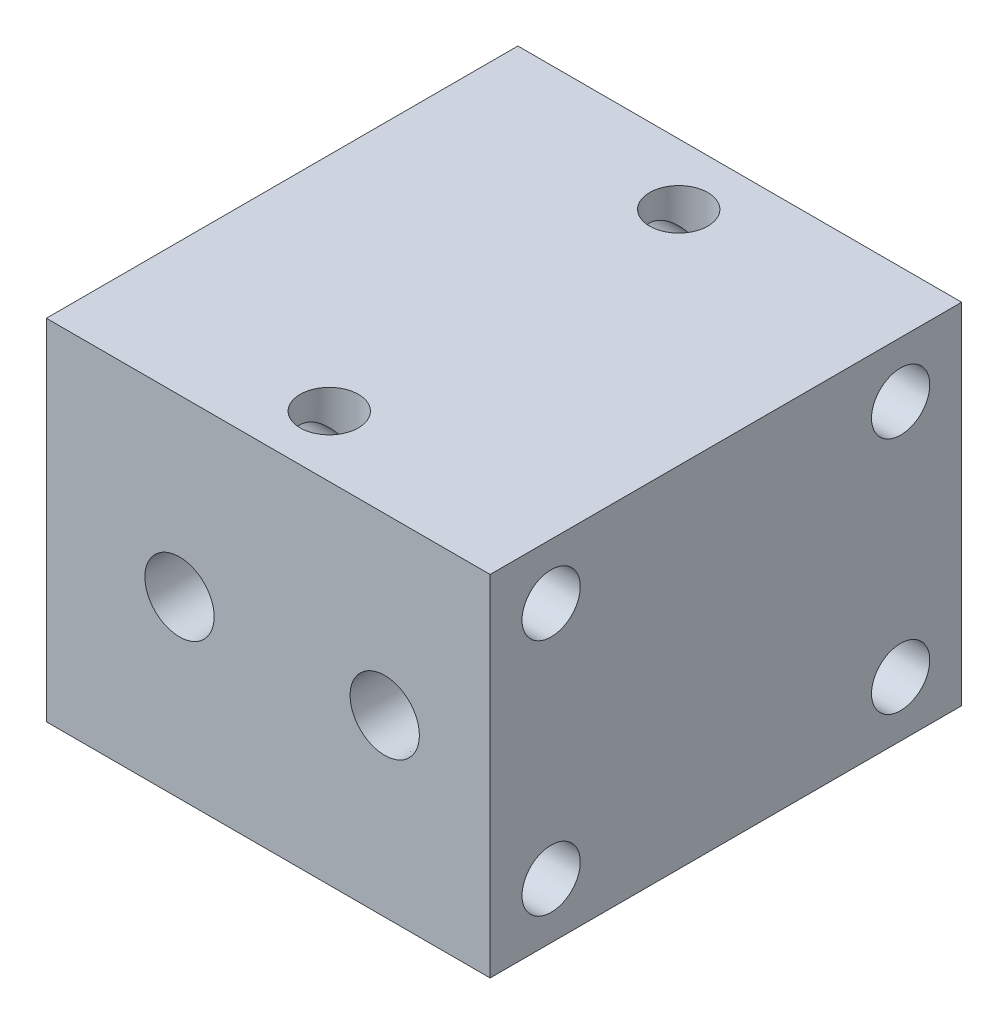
ISO-10303-21;
HEADER;
FILE_DESCRIPTION(('STEP AP214'),'2;1');
FILE_NAME('part.step','',(''),(''),'','','');
FILE_SCHEMA(('AUTOMOTIVE_DESIGN { 1 0 10303 214 1 1 1 1 }'));
ENDSEC;
DATA;
#1=APPLICATION_CONTEXT('core data for automotive mechanical design processes');
#2=APPLICATION_PROTOCOL_DEFINITION('international standard','automotive_design',2000,#1);
#3=PRODUCT_CONTEXT('',#1,'mechanical');
#4=PRODUCT('Part','Part','',(#3));
#5=PRODUCT_RELATED_PRODUCT_CATEGORY('part','',(#4));
#6=PRODUCT_DEFINITION_FORMATION('','',#4);
#7=PRODUCT_DEFINITION_CONTEXT('part definition',#1,'design');
#8=PRODUCT_DEFINITION('design','',#6,#7);
#9=PRODUCT_DEFINITION_SHAPE('','',#8);
#10=(LENGTH_UNIT() NAMED_UNIT(*) SI_UNIT(.MILLI.,.METRE.));
#11=(NAMED_UNIT(*) PLANE_ANGLE_UNIT() SI_UNIT($,.RADIAN.));
#12=(NAMED_UNIT(*) SI_UNIT($,.STERADIAN.) SOLID_ANGLE_UNIT());
#13=UNCERTAINTY_MEASURE_WITH_UNIT(LENGTH_MEASURE(1.E-05),#10,'distance_accuracy_value','');
#14=(GEOMETRIC_REPRESENTATION_CONTEXT(3) GLOBAL_UNCERTAINTY_ASSIGNED_CONTEXT((#13)) GLOBAL_UNIT_ASSIGNED_CONTEXT((#10,
#11,#12)) REPRESENTATION_CONTEXT('',''));
#15=CARTESIAN_POINT('',(0.,0.,0.));
#16=DIRECTION('',(0.,0.,1.));
#17=DIRECTION('',(1.,0.,0.));
#18=AXIS2_PLACEMENT_3D('',#15,#16,#17);
#19=CARTESIAN_POINT('',(0.,63.,31.5));
#20=DIRECTION('',(0.,-1.,0.));
#21=DIRECTION('',(0.,0.,-1.));
#22=AXIS2_PLACEMENT_3D('',#19,#20,#21);
#23=CYLINDRICAL_SURFACE('',#22,5.25);
#24=CARTESIAN_POINT('',(0.,9.99999999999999,31.5));
#25=DIRECTION('',(-0.707106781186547,-0.707106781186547,0.));
#26=DIRECTION('',(0.707106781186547,-0.707106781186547,0.));
#27=AXIS2_PLACEMENT_3D('',#24,#25,#26);
#28=ELLIPSE('',#27,7.42462120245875,5.25);
#29=CARTESIAN_POINT('',(0.,9.99999999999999,26.25));
#30=VERTEX_POINT('',#29);
#31=CARTESIAN_POINT('',(0.,9.99999999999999,36.75));
#32=VERTEX_POINT('',#31);
#33=EDGE_CURVE('E11',#30,#32,#28,.F.);
#34=ORIENTED_EDGE('',*,*,#33,.F.);
#35=CARTESIAN_POINT('',(0.,9.99999999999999,31.5));
#36=DIRECTION('',(0.707106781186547,-0.707106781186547,0.));
#37=DIRECTION('',(-0.707106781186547,-0.707106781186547,0.));
#38=AXIS2_PLACEMENT_3D('',#35,#36,#37);
#39=ELLIPSE('',#38,7.42462120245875,5.25);
#40=EDGE_CURVE('E51',#32,#30,#39,.F.);
#41=ORIENTED_EDGE('',*,*,#40,.F.);
#42=EDGE_LOOP('',(#34,#41));
#43=FACE_BOUND('',#42,.T.);
#44=CARTESIAN_POINT('',(0.,53.,31.5));
#45=DIRECTION('',(-0.707106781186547,-0.707106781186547,0.));
#46=DIRECTION('',(0.707106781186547,-0.707106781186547,0.));
#47=AXIS2_PLACEMENT_3D('',#44,#45,#46);
#48=ELLIPSE('',#47,7.42462120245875,5.25);
#49=CARTESIAN_POINT('',(0.,53.,26.25));
#50=VERTEX_POINT('',#49);
#51=CARTESIAN_POINT('',(0.,53.,36.75));
#52=VERTEX_POINT('',#51);
#53=EDGE_CURVE('E265',#50,#52,#48,.T.);
#54=ORIENTED_EDGE('',*,*,#53,.F.);
#55=CARTESIAN_POINT('',(0.,53.,31.5));
#56=DIRECTION('',(0.707106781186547,-0.707106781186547,0.));
#57=DIRECTION('',(-0.707106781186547,-0.707106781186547,0.));
#58=AXIS2_PLACEMENT_3D('',#55,#56,#57);
#59=ELLIPSE('',#58,7.42462120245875,5.25);
#60=EDGE_CURVE('E263',#52,#50,#59,.T.);
#61=ORIENTED_EDGE('',*,*,#60,.F.);
#62=EDGE_LOOP('',(#54,#61));
#63=FACE_BOUND('',#62,.T.);
#64=ADVANCED_FACE('F35',(#43,#63),#23,.F.);
#65=CARTESIAN_POINT('',(0.,53.,31.5));
#66=DIRECTION('',(-0.707106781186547,-0.707106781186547,0.));
#67=DIRECTION('',(0.707106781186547,-0.707106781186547,0.));
#68=AXIS2_PLACEMENT_3D('',#65,#66,#67);
#69=ELLIPSE('',#68,7.42462120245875,5.25);
#70=EDGE_CURVE('E118',#50,#52,#69,.F.);
#71=ORIENTED_EDGE('',*,*,#70,.F.);
#72=CARTESIAN_POINT('',(0.,53.,31.5));
#73=DIRECTION('',(0.707106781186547,-0.707106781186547,0.));
#74=DIRECTION('',(-0.707106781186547,-0.707106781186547,0.));
#75=AXIS2_PLACEMENT_3D('',#72,#73,#74);
#76=ELLIPSE('',#75,7.42462120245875,5.25);
#77=EDGE_CURVE('E58',#52,#50,#76,.F.);
#78=ORIENTED_EDGE('',*,*,#77,.F.);
#79=EDGE_LOOP('',(#71,#78));
#80=FACE_BOUND('',#79,.T.);
#81=CARTESIAN_POINT('',(0.,63.,31.5));
#82=DIRECTION('',(0.,1.,0.));
#83=DIRECTION('',(0.,0.,1.));
#84=AXIS2_PLACEMENT_3D('',#81,#82,#83);
#85=CIRCLE('',#84,5.25);
#86=CARTESIAN_POINT('',(0.,63.,36.75));
#87=VERTEX_POINT('',#86);
#88=EDGE_CURVE('E199',#87,#87,#85,.T.);
#89=ORIENTED_EDGE('',*,*,#88,.T.);
#90=EDGE_LOOP('',(#89));
#91=FACE_BOUND('',#90,.T.);
#92=ADVANCED_FACE('F320',(#80,#91),#23,.F.);
#93=CARTESIAN_POINT('',(0.,63.,-31.5));
#94=DIRECTION('',(0.,-1.,0.));
#95=DIRECTION('',(0.,0.,-1.));
#96=AXIS2_PLACEMENT_3D('',#93,#94,#95);
#97=CYLINDRICAL_SURFACE('',#96,5.25);
#98=CARTESIAN_POINT('',(0.,9.99999999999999,-31.5));
#99=DIRECTION('',(-0.707106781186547,-0.707106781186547,0.));
#100=DIRECTION('',(0.707106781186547,-0.707106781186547,0.));
#101=AXIS2_PLACEMENT_3D('',#98,#99,#100);
#102=ELLIPSE('',#101,7.42462120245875,5.25);
#103=CARTESIAN_POINT('',(0.,9.99999999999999,-36.75));
#104=VERTEX_POINT('',#103);
#105=CARTESIAN_POINT('',(0.,9.99999999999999,-26.25));
#106=VERTEX_POINT('',#105);
#107=EDGE_CURVE('E259',#104,#106,#102,.F.);
#108=ORIENTED_EDGE('',*,*,#107,.F.);
#109=CARTESIAN_POINT('',(0.,9.99999999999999,-31.5));
#110=DIRECTION('',(0.707106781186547,-0.707106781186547,0.));
#111=DIRECTION('',(-0.707106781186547,-0.707106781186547,0.));
#112=AXIS2_PLACEMENT_3D('',#109,#110,#111);
#113=ELLIPSE('',#112,7.42462120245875,5.25);
#114=EDGE_CURVE('E251',#106,#104,#113,.F.);
#115=ORIENTED_EDGE('',*,*,#114,.F.);
#116=EDGE_LOOP('',(#108,#115));
#117=FACE_BOUND('',#116,.T.);
#118=CARTESIAN_POINT('',(0.,53.,-31.5));
#119=DIRECTION('',(-0.707106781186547,-0.707106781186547,0.));
#120=DIRECTION('',(0.707106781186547,-0.707106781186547,0.));
#121=AXIS2_PLACEMENT_3D('',#118,#119,#120);
#122=ELLIPSE('',#121,7.42462120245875,5.25);
#123=CARTESIAN_POINT('',(0.,53.,-36.75));
#124=VERTEX_POINT('',#123);
#125=CARTESIAN_POINT('',(0.,53.,-26.25));
#126=VERTEX_POINT('',#125);
#127=EDGE_CURVE('E245',#124,#126,#122,.T.);
#128=ORIENTED_EDGE('',*,*,#127,.F.);
#129=CARTESIAN_POINT('',(0.,53.,-31.5));
#130=DIRECTION('',(0.707106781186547,-0.707106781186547,0.));
#131=DIRECTION('',(-0.707106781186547,-0.707106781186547,0.));
#132=AXIS2_PLACEMENT_3D('',#129,#130,#131);
#133=ELLIPSE('',#132,7.42462120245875,5.25);
#134=EDGE_CURVE('E243',#126,#124,#133,.T.);
#135=ORIENTED_EDGE('',*,*,#134,.F.);
#136=EDGE_LOOP('',(#128,#135));
#137=FACE_BOUND('',#136,.T.);
#138=ADVANCED_FACE('F325',(#117,#137),#97,.F.);
#139=CARTESIAN_POINT('',(0.,53.,-31.5));
#140=DIRECTION('',(-0.707106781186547,-0.707106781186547,0.));
#141=DIRECTION('',(0.707106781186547,-0.707106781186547,0.));
#142=AXIS2_PLACEMENT_3D('',#139,#140,#141);
#143=ELLIPSE('',#142,7.42462120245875,5.25);
#144=EDGE_CURVE('E248',#124,#126,#143,.F.);
#145=ORIENTED_EDGE('',*,*,#144,.F.);
#146=CARTESIAN_POINT('',(0.,53.,-31.5));
#147=DIRECTION('',(0.707106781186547,-0.707106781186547,0.));
#148=DIRECTION('',(-0.707106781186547,-0.707106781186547,0.));
#149=AXIS2_PLACEMENT_3D('',#146,#147,#148);
#150=ELLIPSE('',#149,7.42462120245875,5.25);
#151=EDGE_CURVE('E240',#126,#124,#150,.F.);
#152=ORIENTED_EDGE('',*,*,#151,.F.);
#153=EDGE_LOOP('',(#145,#152));
#154=FACE_BOUND('',#153,.T.);
#155=CARTESIAN_POINT('',(0.,63.,-31.5));
#156=DIRECTION('',(0.,1.,0.));
#157=DIRECTION('',(0.,0.,1.));
#158=AXIS2_PLACEMENT_3D('',#155,#156,#157);
#159=CIRCLE('',#158,5.25);
#160=CARTESIAN_POINT('',(0.,63.,-26.25));
#161=VERTEX_POINT('',#160);
#162=EDGE_CURVE('E205',#161,#161,#159,.T.);
#163=ORIENTED_EDGE('',*,*,#162,.T.);
#164=EDGE_LOOP('',(#163));
#165=FACE_BOUND('',#164,.T.);
#166=ADVANCED_FACE('F338',(#154,#165),#97,.F.);
#167=CARTESIAN_POINT('',(-40.,63.,42.5));
#168=DIRECTION('',(0.,1.,0.));
#169=DIRECTION('',(0.,0.,1.));
#170=AXIS2_PLACEMENT_3D('',#167,#168,#169);
#171=PLANE('',#170);
#172=ORIENTED_EDGE('',*,*,#162,.F.);
#173=EDGE_LOOP('',(#172));
#174=FACE_BOUND('',#173,.T.);
#175=DIRECTION('',(0.,0.,1.));
#176=VECTOR('',#175,1.);
#177=CARTESIAN_POINT('',(-40.,63.,-42.5));
#178=LINE('',#177,#176);
#179=CARTESIAN_POINT('',(-40.,63.,-42.5));
#180=VERTEX_POINT('',#179);
#181=CARTESIAN_POINT('',(-40.,63.,42.5));
#182=VERTEX_POINT('',#181);
#183=EDGE_CURVE('E211',#180,#182,#178,.T.);
#184=ORIENTED_EDGE('',*,*,#183,.T.);
#185=DIRECTION('',(1.,0.,0.));
#186=VECTOR('',#185,1.);
#187=CARTESIAN_POINT('',(-40.,63.,42.5));
#188=LINE('',#187,#186);
#189=CARTESIAN_POINT('',(40.,63.,42.5));
#190=VERTEX_POINT('',#189);
#191=EDGE_CURVE('E214',#182,#190,#188,.T.);
#192=ORIENTED_EDGE('',*,*,#191,.T.);
#193=DIRECTION('',(0.,0.,-1.));
#194=VECTOR('',#193,1.);
#195=CARTESIAN_POINT('',(40.,63.,-42.5));
#196=LINE('',#195,#194);
#197=CARTESIAN_POINT('',(40.,63.,-42.5));
#198=VERTEX_POINT('',#197);
#199=EDGE_CURVE('E217',#190,#198,#196,.T.);
#200=ORIENTED_EDGE('',*,*,#199,.T.);
#201=DIRECTION('',(-1.,0.,0.));
#202=VECTOR('',#201,1.);
#203=CARTESIAN_POINT('',(-40.,63.,-42.5));
#204=LINE('',#203,#202);
#205=EDGE_CURVE('E219',#198,#180,#204,.T.);
#206=ORIENTED_EDGE('',*,*,#205,.T.);
#207=EDGE_LOOP('',(#184,#192,#200,#206));
#208=FACE_BOUND('',#207,.T.);
#209=ORIENTED_EDGE('',*,*,#88,.F.);
#210=EDGE_LOOP('',(#209));
#211=FACE_BOUND('',#210,.T.);
#212=ADVANCED_FACE('F308',(#174,#208,#211),#171,.T.);
#213=CARTESIAN_POINT('',(-40.,0.,42.5));
#214=DIRECTION('',(0.,1.,0.));
#215=DIRECTION('',(0.,0.,1.));
#216=AXIS2_PLACEMENT_3D('',#213,#214,#215);
#217=PLANE('',#216);
#218=CARTESIAN_POINT('',(0.,0.,-31.5));
#219=DIRECTION('',(0.,1.,0.));
#220=DIRECTION('',(0.,0.,1.));
#221=AXIS2_PLACEMENT_3D('',#218,#219,#220);
#222=CIRCLE('',#221,5.25);
#223=CARTESIAN_POINT('',(0.,0.,-26.25));
#224=VERTEX_POINT('',#223);
#225=EDGE_CURVE('E202',#224,#224,#222,.T.);
#226=ORIENTED_EDGE('',*,*,#225,.T.);
#227=EDGE_LOOP('',(#226));
#228=FACE_BOUND('',#227,.T.);
#229=DIRECTION('',(0.,0.,1.));
#230=VECTOR('',#229,1.);
#231=CARTESIAN_POINT('',(-40.,0.,-42.5));
#232=LINE('',#231,#230);
#233=CARTESIAN_POINT('',(-40.,0.,-42.5));
#234=VERTEX_POINT('',#233);
#235=CARTESIAN_POINT('',(-40.,0.,42.5));
#236=VERTEX_POINT('',#235);
#237=EDGE_CURVE('E208',#234,#236,#232,.T.);
#238=ORIENTED_EDGE('',*,*,#237,.F.);
#239=DIRECTION('',(-1.,0.,0.));
#240=VECTOR('',#239,1.);
#241=CARTESIAN_POINT('',(-40.,0.,-42.5));
#242=LINE('',#241,#240);
#243=CARTESIAN_POINT('',(40.,0.,-42.5));
#244=VERTEX_POINT('',#243);
#245=EDGE_CURVE('E215',#244,#234,#242,.T.);
#246=ORIENTED_EDGE('',*,*,#245,.F.);
#247=DIRECTION('',(0.,0.,-1.));
#248=VECTOR('',#247,1.);
#249=CARTESIAN_POINT('',(40.,0.,-42.5));
#250=LINE('',#249,#248);
#251=CARTESIAN_POINT('',(40.,0.,42.5));
#252=VERTEX_POINT('',#251);
#253=EDGE_CURVE('E226',#252,#244,#250,.T.);
#254=ORIENTED_EDGE('',*,*,#253,.F.);
#255=DIRECTION('',(1.,0.,0.));
#256=VECTOR('',#255,1.);
#257=CARTESIAN_POINT('',(-40.,0.,42.5));
#258=LINE('',#257,#256);
#259=EDGE_CURVE('E224',#236,#252,#258,.T.);
#260=ORIENTED_EDGE('',*,*,#259,.F.);
#261=EDGE_LOOP('',(#238,#246,#254,#260));
#262=FACE_BOUND('',#261,.T.);
#263=CARTESIAN_POINT('',(0.,0.,31.5));
#264=DIRECTION('',(0.,1.,0.));
#265=DIRECTION('',(0.,0.,1.));
#266=AXIS2_PLACEMENT_3D('',#263,#264,#265);
#267=CIRCLE('',#266,5.25);
#268=CARTESIAN_POINT('',(0.,0.,36.75));
#269=VERTEX_POINT('',#268);
#270=EDGE_CURVE('E196',#269,#269,#267,.T.);
#271=ORIENTED_EDGE('',*,*,#270,.T.);
#272=EDGE_LOOP('',(#271));
#273=FACE_BOUND('',#272,.T.);
#274=ADVANCED_FACE('F302',(#228,#262,#273),#217,.F.);
#275=CARTESIAN_POINT('',(-40.,63.,-42.5));
#276=DIRECTION('',(1.,0.,0.));
#277=DIRECTION('',(0.,0.,-1.));
#278=AXIS2_PLACEMENT_3D('',#275,#276,#277);
#279=PLANE('',#278);
#280=CARTESIAN_POINT('',(-40.,9.99999999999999,31.5));
#281=DIRECTION('',(-1.,0.,0.));
#282=DIRECTION('',(0.,0.,1.));
#283=AXIS2_PLACEMENT_3D('',#280,#281,#282);
#284=CIRCLE('',#283,5.25);
#285=CARTESIAN_POINT('',(-40.,9.99999999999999,36.75));
#286=VERTEX_POINT('',#285);
#287=EDGE_CURVE('E131',#286,#286,#284,.T.);
#288=ORIENTED_EDGE('',*,*,#287,.F.);
#289=EDGE_LOOP('',(#288));
#290=FACE_BOUND('',#289,.T.);
#291=CARTESIAN_POINT('',(-40.,53.,31.5));
#292=DIRECTION('',(-1.,0.,0.));
#293=DIRECTION('',(0.,0.,1.));
#294=AXIS2_PLACEMENT_3D('',#291,#292,#293);
#295=CIRCLE('',#294,5.25);
#296=CARTESIAN_POINT('',(-40.,53.,36.75));
#297=VERTEX_POINT('',#296);
#298=EDGE_CURVE('E150',#297,#297,#295,.T.);
#299=ORIENTED_EDGE('',*,*,#298,.F.);
#300=EDGE_LOOP('',(#299));
#301=FACE_BOUND('',#300,.T.);
#302=CARTESIAN_POINT('',(-40.,9.99999999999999,-31.5));
#303=DIRECTION('',(-1.,0.,0.));
#304=DIRECTION('',(0.,0.,1.));
#305=AXIS2_PLACEMENT_3D('',#302,#303,#304);
#306=CIRCLE('',#305,5.25);
#307=CARTESIAN_POINT('',(-40.,9.99999999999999,-26.25));
#308=VERTEX_POINT('',#307);
#309=EDGE_CURVE('E156',#308,#308,#306,.T.);
#310=ORIENTED_EDGE('',*,*,#309,.F.);
#311=EDGE_LOOP('',(#310));
#312=FACE_BOUND('',#311,.T.);
#313=CARTESIAN_POINT('',(-40.,53.,-31.5));
#314=DIRECTION('',(-1.,0.,0.));
#315=DIRECTION('',(0.,0.,1.));
#316=AXIS2_PLACEMENT_3D('',#313,#314,#315);
#317=CIRCLE('',#316,5.25);
#318=CARTESIAN_POINT('',(-40.,53.,-26.25));
#319=VERTEX_POINT('',#318);
#320=EDGE_CURVE('E162',#319,#319,#317,.T.);
#321=ORIENTED_EDGE('',*,*,#320,.F.);
#322=EDGE_LOOP('',(#321));
#323=FACE_BOUND('',#322,.T.);
#324=CARTESIAN_POINT('',(-40.,31.5,0.));
#325=DIRECTION('',(-1.,0.,0.));
#326=DIRECTION('',(0.,0.,1.));
#327=AXIS2_PLACEMENT_3D('',#324,#325,#326);
#328=CIRCLE('',#327,0.5);
#329=CARTESIAN_POINT('',(-40.,31.5,0.5));
#330=VERTEX_POINT('',#329);
#331=EDGE_CURVE('E192',#330,#330,#328,.T.);
#332=ORIENTED_EDGE('',*,*,#331,.F.);
#333=EDGE_LOOP('',(#332));
#334=FACE_BOUND('',#333,.T.);
#335=ORIENTED_EDGE('',*,*,#237,.T.);
#336=DIRECTION('',(0.,-1.,0.));
#337=VECTOR('',#336,1.);
#338=CARTESIAN_POINT('',(-40.,63.,42.5));
#339=LINE('',#338,#337);
#340=EDGE_CURVE('E237',#182,#236,#339,.T.);
#341=ORIENTED_EDGE('',*,*,#340,.F.);
#342=ORIENTED_EDGE('',*,*,#183,.F.);
#343=DIRECTION('',(0.,-1.,0.));
#344=VECTOR('',#343,1.);
#345=CARTESIAN_POINT('',(-40.,63.,-42.5));
#346=LINE('',#345,#344);
#347=EDGE_CURVE('E221',#180,#234,#346,.T.);
#348=ORIENTED_EDGE('',*,*,#347,.T.);
#349=EDGE_LOOP('',(#335,#341,#342,#348));
#350=FACE_BOUND('',#349,.T.);
#351=ADVANCED_FACE('F37',(#290,#301,#312,#323,#334,#350),#279,.F.);
#352=CARTESIAN_POINT('',(-40.,63.,42.5));
#353=DIRECTION('',(0.,0.,-1.));
#354=DIRECTION('',(-1.,0.,0.));
#355=AXIS2_PLACEMENT_3D('',#352,#353,#354);
#356=PLANE('',#355);
#357=CARTESIAN_POINT('',(21.,31.5,42.5));
#358=DIRECTION('',(0.,0.,1.));
#359=DIRECTION('',(1.,0.,0.));
#360=AXIS2_PLACEMENT_3D('',#357,#358,#359);
#361=CIRCLE('',#360,6.2436883);
#362=CARTESIAN_POINT('',(27.2436883,31.5,42.5));
#363=VERTEX_POINT('',#362);
#364=EDGE_CURVE('E168',#363,#363,#361,.T.);
#365=ORIENTED_EDGE('',*,*,#364,.F.);
#366=EDGE_LOOP('',(#365));
#367=FACE_BOUND('',#366,.T.);
#368=CARTESIAN_POINT('',(-16.,31.5,42.5));
#369=DIRECTION('',(0.,0.,1.));
#370=DIRECTION('',(1.,0.,0.));
#371=AXIS2_PLACEMENT_3D('',#368,#369,#370);
#372=CIRCLE('',#371,6.2436883);
#373=CARTESIAN_POINT('',(-9.7563117,31.5,42.5));
#374=VERTEX_POINT('',#373);
#375=EDGE_CURVE('E180',#374,#374,#372,.T.);
#376=ORIENTED_EDGE('',*,*,#375,.F.);
#377=EDGE_LOOP('',(#376));
#378=FACE_BOUND('',#377,.T.);
#379=ORIENTED_EDGE('',*,*,#259,.T.);
#380=DIRECTION('',(0.,-1.,0.));
#381=VECTOR('',#380,1.);
#382=CARTESIAN_POINT('',(40.,63.,42.5));
#383=LINE('',#382,#381);
#384=EDGE_CURVE('E234',#190,#252,#383,.T.);
#385=ORIENTED_EDGE('',*,*,#384,.F.);
#386=ORIENTED_EDGE('',*,*,#191,.F.);
#387=ORIENTED_EDGE('',*,*,#340,.T.);
#388=EDGE_LOOP('',(#379,#385,#386,#387));
#389=FACE_BOUND('',#388,.T.);
#390=ADVANCED_FACE('F285',(#367,#378,#389),#356,.F.);
#391=CARTESIAN_POINT('',(40.,63.,-42.5));
#392=DIRECTION('',(-1.,0.,0.));
#393=DIRECTION('',(0.,0.,1.));
#394=AXIS2_PLACEMENT_3D('',#391,#392,#393);
#395=PLANE('',#394);
#396=CARTESIAN_POINT('',(40.,9.99999999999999,31.5));
#397=DIRECTION('',(-1.,0.,0.));
#398=DIRECTION('',(0.,0.,1.));
#399=AXIS2_PLACEMENT_3D('',#396,#397,#398);
#400=CIRCLE('',#399,5.25);
#401=CARTESIAN_POINT('',(40.,9.99999999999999,36.75));
#402=VERTEX_POINT('',#401);
#403=EDGE_CURVE('E147',#402,#402,#400,.F.);
#404=ORIENTED_EDGE('',*,*,#403,.F.);
#405=EDGE_LOOP('',(#404));
#406=FACE_BOUND('',#405,.T.);
#407=CARTESIAN_POINT('',(40.,53.,31.5));
#408=DIRECTION('',(-1.,0.,0.));
#409=DIRECTION('',(0.,0.,1.));
#410=AXIS2_PLACEMENT_3D('',#407,#408,#409);
#411=CIRCLE('',#410,5.25);
#412=CARTESIAN_POINT('',(40.,53.,36.75));
#413=VERTEX_POINT('',#412);
#414=EDGE_CURVE('E153',#413,#413,#411,.F.);
#415=ORIENTED_EDGE('',*,*,#414,.F.);
#416=EDGE_LOOP('',(#415));
#417=FACE_BOUND('',#416,.T.);
#418=CARTESIAN_POINT('',(40.,9.99999999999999,-31.5));
#419=DIRECTION('',(-1.,0.,0.));
#420=DIRECTION('',(0.,0.,1.));
#421=AXIS2_PLACEMENT_3D('',#418,#419,#420);
#422=CIRCLE('',#421,5.25);
#423=CARTESIAN_POINT('',(40.,9.99999999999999,-26.25));
#424=VERTEX_POINT('',#423);
#425=EDGE_CURVE('E159',#424,#424,#422,.F.);
#426=ORIENTED_EDGE('',*,*,#425,.F.);
#427=EDGE_LOOP('',(#426));
#428=FACE_BOUND('',#427,.T.);
#429=CARTESIAN_POINT('',(40.,53.,-31.5));
#430=DIRECTION('',(-1.,0.,0.));
#431=DIRECTION('',(0.,0.,1.));
#432=AXIS2_PLACEMENT_3D('',#429,#430,#431);
#433=CIRCLE('',#432,5.25);
#434=CARTESIAN_POINT('',(40.,53.,-26.25));
#435=VERTEX_POINT('',#434);
#436=EDGE_CURVE('E165',#435,#435,#433,.F.);
#437=ORIENTED_EDGE('',*,*,#436,.F.);
#438=EDGE_LOOP('',(#437));
#439=FACE_BOUND('',#438,.T.);
#440=ORIENTED_EDGE('',*,*,#253,.T.);
#441=DIRECTION('',(0.,-1.,0.));
#442=VECTOR('',#441,1.);
#443=CARTESIAN_POINT('',(40.,63.,-42.5));
#444=LINE('',#443,#442);
#445=EDGE_CURVE('E231',#198,#244,#444,.T.);
#446=ORIENTED_EDGE('',*,*,#445,.F.);
#447=ORIENTED_EDGE('',*,*,#199,.F.);
#448=ORIENTED_EDGE('',*,*,#384,.T.);
#449=EDGE_LOOP('',(#440,#446,#447,#448));
#450=FACE_BOUND('',#449,.T.);
#451=ADVANCED_FACE('F281',(#406,#417,#428,#439,#450),#395,.F.);
#452=CARTESIAN_POINT('',(-40.,63.,-42.5));
#453=DIRECTION('',(0.,0.,1.));
#454=DIRECTION('',(1.,0.,0.));
#455=AXIS2_PLACEMENT_3D('',#452,#453,#454);
#456=PLANE('',#455);
#457=ORIENTED_EDGE('',*,*,#245,.T.);
#458=ORIENTED_EDGE('',*,*,#347,.F.);
#459=ORIENTED_EDGE('',*,*,#205,.F.);
#460=ORIENTED_EDGE('',*,*,#445,.T.);
#461=EDGE_LOOP('',(#457,#458,#459,#460));
#462=FACE_BOUND('',#461,.T.);
#463=ADVANCED_FACE('F284',(#462),#456,.F.);
#464=CARTESIAN_POINT('',(0.,9.99999999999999,-31.5));
#465=DIRECTION('',(-0.707106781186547,-0.707106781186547,0.));
#466=DIRECTION('',(0.707106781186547,-0.707106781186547,0.));
#467=AXIS2_PLACEMENT_3D('',#464,#465,#466);
#468=ELLIPSE('',#467,7.42462120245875,5.25);
#469=EDGE_CURVE('E256',#104,#106,#468,.T.);
#470=ORIENTED_EDGE('',*,*,#469,.F.);
#471=CARTESIAN_POINT('',(0.,9.99999999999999,-31.5));
#472=DIRECTION('',(0.707106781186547,-0.707106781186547,0.));
#473=DIRECTION('',(-0.707106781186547,-0.707106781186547,0.));
#474=AXIS2_PLACEMENT_3D('',#471,#472,#473);
#475=ELLIPSE('',#474,7.42462120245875,5.25);
#476=EDGE_CURVE('E254',#106,#104,#475,.T.);
#477=ORIENTED_EDGE('',*,*,#476,.F.);
#478=EDGE_LOOP('',(#470,#477));
#479=FACE_BOUND('',#478,.T.);
#480=ORIENTED_EDGE('',*,*,#225,.F.);
#481=EDGE_LOOP('',(#480));
#482=FACE_BOUND('',#481,.T.);
#483=ADVANCED_FACE('F330',(#479,#482),#97,.F.);
#484=CARTESIAN_POINT('',(0.,9.99999999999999,31.5));
#485=DIRECTION('',(-0.707106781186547,-0.707106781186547,0.));
#486=DIRECTION('',(0.707106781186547,-0.707106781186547,0.));
#487=AXIS2_PLACEMENT_3D('',#484,#485,#486);
#488=ELLIPSE('',#487,7.42462120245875,5.25);
#489=EDGE_CURVE('E44',#30,#32,#488,.T.);
#490=ORIENTED_EDGE('',*,*,#489,.F.);
#491=CARTESIAN_POINT('',(0.,9.99999999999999,31.5));
#492=DIRECTION('',(0.707106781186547,-0.707106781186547,0.));
#493=DIRECTION('',(-0.707106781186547,-0.707106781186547,0.));
#494=AXIS2_PLACEMENT_3D('',#491,#492,#493);
#495=ELLIPSE('',#494,7.42462120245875,5.25);
#496=EDGE_CURVE('E109',#32,#30,#495,.T.);
#497=ORIENTED_EDGE('',*,*,#496,.F.);
#498=EDGE_LOOP('',(#490,#497));
#499=FACE_BOUND('',#498,.T.);
#500=ORIENTED_EDGE('',*,*,#270,.F.);
#501=EDGE_LOOP('',(#500));
#502=FACE_BOUND('',#501,.T.);
#503=ADVANCED_FACE('F121',(#499,#502),#23,.F.);
#504=CARTESIAN_POINT('',(20.,31.5,0.));
#505=DIRECTION('',(-1.,0.,0.));
#506=DIRECTION('',(0.,0.,1.));
#507=AXIS2_PLACEMENT_3D('',#504,#505,#506);
#508=CYLINDRICAL_SURFACE('',#507,0.5);
#509=CARTESIAN_POINT('',(20.,31.5,0.));
#510=DIRECTION('',(-1.,0.,0.));
#511=DIRECTION('',(0.,0.,1.));
#512=AXIS2_PLACEMENT_3D('',#509,#510,#511);
#513=CIRCLE('',#512,0.5);
#514=CARTESIAN_POINT('',(20.,31.5,0.499999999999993));
#515=VERTEX_POINT('',#514);
#516=EDGE_CURVE('E193',#515,#515,#513,.T.);
#517=ORIENTED_EDGE('',*,*,#516,.F.);
#518=EDGE_LOOP('',(#517));
#519=FACE_BOUND('',#518,.T.);
#520=ORIENTED_EDGE('',*,*,#331,.T.);
#521=EDGE_LOOP('',(#520));
#522=FACE_BOUND('',#521,.T.);
#523=ADVANCED_FACE('F329',(#519,#522),#508,.F.);
#524=CARTESIAN_POINT('',(20.,31.5,0.));
#525=DIRECTION('',(-1.,0.,0.));
#526=DIRECTION('',(0.,0.,1.));
#527=AXIS2_PLACEMENT_3D('',#524,#525,#526);
#528=PLANE('',#527);
#529=ORIENTED_EDGE('',*,*,#516,.T.);
#530=EDGE_LOOP('',(#529));
#531=FACE_BOUND('',#530,.T.);
#532=ADVANCED_FACE('F335',(#531),#528,.T.);
#533=CARTESIAN_POINT('',(-16.,31.5,25.43));
#534=DIRECTION('',(0.,0.,1.));
#535=DIRECTION('',(1.,0.,0.));
#536=AXIS2_PLACEMENT_3D('',#533,#534,#535);
#537=CONICAL_SURFACE('',#536,5.5626,1.02974425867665);
#538=CARTESIAN_POINT('',(-16.,31.5,23.2893739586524));
#539=DIRECTION('',(0.,0.,1.));
#540=DIRECTION('',(1.,0.,0.));
#541=AXIS2_PLACEMENT_3D('',#538,#539,#540);
#542=CIRCLE('',#541,2.00000000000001);
#543=CARTESIAN_POINT('',(-14.,31.5,23.2893739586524));
#544=VERTEX_POINT('',#543);
#545=EDGE_CURVE('E128',#544,#544,#542,.F.);
#546=ORIENTED_EDGE('',*,*,#545,.T.);
#547=EDGE_LOOP('',(#546));
#548=FACE_BOUND('',#547,.T.);
#549=CARTESIAN_POINT('',(-16.,31.5,25.43));
#550=DIRECTION('',(0.,0.,1.));
#551=DIRECTION('',(1.,0.,0.));
#552=AXIS2_PLACEMENT_3D('',#549,#550,#551);
#553=CIRCLE('',#552,5.5626);
#554=CARTESIAN_POINT('',(-10.4374,31.5,25.43));
#555=VERTEX_POINT('',#554);
#556=EDGE_CURVE('E189',#555,#555,#553,.T.);
#557=ORIENTED_EDGE('',*,*,#556,.T.);
#558=EDGE_LOOP('',(#557));
#559=FACE_BOUND('',#558,.T.);
#560=ADVANCED_FACE('F401',(#548,#559),#537,.F.);
#561=CARTESIAN_POINT('',(-16.,31.5,42.5));
#562=DIRECTION('',(0.,0.,1.));
#563=DIRECTION('',(1.,0.,0.));
#564=AXIS2_PLACEMENT_3D('',#561,#562,#563);
#565=CYLINDRICAL_SURFACE('',#564,5.5626);
#566=ORIENTED_EDGE('',*,*,#556,.F.);
#567=EDGE_LOOP('',(#566));
#568=FACE_BOUND('',#567,.T.);
#569=CARTESIAN_POINT('',(-16.,31.5,32.48));
#570=DIRECTION('',(0.,0.,1.));
#571=DIRECTION('',(1.,0.,0.));
#572=AXIS2_PLACEMENT_3D('',#569,#570,#571);
#573=CIRCLE('',#572,5.5626);
#574=CARTESIAN_POINT('',(-10.4374,31.5,32.48));
#575=VERTEX_POINT('',#574);
#576=EDGE_CURVE('E186',#575,#575,#573,.T.);
#577=ORIENTED_EDGE('',*,*,#576,.T.);
#578=EDGE_LOOP('',(#577));
#579=FACE_BOUND('',#578,.T.);
#580=ADVANCED_FACE('F397',(#568,#579),#565,.F.);
#581=CARTESIAN_POINT('',(-10.4374,31.5,32.48));
#582=DIRECTION('',(0.,0.,-1.));
#583=DIRECTION('',(-1.,0.,0.));
#584=AXIS2_PLACEMENT_3D('',#581,#582,#583);
#585=PLANE('',#584);
#586=ORIENTED_EDGE('',*,*,#576,.F.);
#587=EDGE_LOOP('',(#586));
#588=FACE_BOUND('',#587,.T.);
#589=CARTESIAN_POINT('',(-16.,31.5,32.48));
#590=DIRECTION('',(0.,0.,1.));
#591=DIRECTION('',(1.,0.,0.));
#592=AXIS2_PLACEMENT_3D('',#589,#590,#591);
#593=CIRCLE('',#592,5.94367608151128);
#594=CARTESIAN_POINT('',(-10.0563239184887,31.5,32.48));
#595=VERTEX_POINT('',#594);
#596=EDGE_CURVE('E183',#595,#595,#593,.T.);
#597=ORIENTED_EDGE('',*,*,#596,.T.);
#598=EDGE_LOOP('',(#597));
#599=FACE_BOUND('',#598,.T.);
#600=ADVANCED_FACE('F393',(#588,#599),#585,.F.);
#601=CARTESIAN_POINT('',(-16.,31.5,42.5));
#602=DIRECTION('',(0.,0.,1.));
#603=DIRECTION('',(1.,0.,0.));
#604=AXIS2_PLACEMENT_3D('',#601,#602,#603);
#605=CONICAL_SURFACE('',#604,6.2436883,0.0299323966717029);
#606=ORIENTED_EDGE('',*,*,#596,.F.);
#607=EDGE_LOOP('',(#606));
#608=FACE_BOUND('',#607,.T.);
#609=ORIENTED_EDGE('',*,*,#375,.T.);
#610=EDGE_LOOP('',(#609));
#611=FACE_BOUND('',#610,.T.);
#612=ADVANCED_FACE('F388',(#608,#611),#605,.F.);
#613=CARTESIAN_POINT('',(21.,31.5,25.43));
#614=DIRECTION('',(0.,0.,1.));
#615=DIRECTION('',(1.,0.,0.));
#616=AXIS2_PLACEMENT_3D('',#613,#614,#615);
#617=CONICAL_SURFACE('',#616,5.5626,1.02974425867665);
#618=CARTESIAN_POINT('',(21.,31.5,23.2893739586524));
#619=DIRECTION('',(0.,0.,1.));
#620=DIRECTION('',(1.,0.,0.));
#621=AXIS2_PLACEMENT_3D('',#618,#619,#620);
#622=CIRCLE('',#621,2.);
#623=CARTESIAN_POINT('',(23.,31.5,23.2893739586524));
#624=VERTEX_POINT('',#623);
#625=EDGE_CURVE('E39',#624,#624,#622,.F.);
#626=ORIENTED_EDGE('',*,*,#625,.T.);
#627=EDGE_LOOP('',(#626));
#628=FACE_BOUND('',#627,.T.);
#629=CARTESIAN_POINT('',(21.,31.5,25.43));
#630=DIRECTION('',(0.,0.,1.));
#631=DIRECTION('',(1.,0.,0.));
#632=AXIS2_PLACEMENT_3D('',#629,#630,#631);
#633=CIRCLE('',#632,5.5626);
#634=CARTESIAN_POINT('',(26.5626,31.5,25.43));
#635=VERTEX_POINT('',#634);
#636=EDGE_CURVE('E177',#635,#635,#633,.T.);
#637=ORIENTED_EDGE('',*,*,#636,.T.);
#638=EDGE_LOOP('',(#637));
#639=FACE_BOUND('',#638,.T.);
#640=ADVANCED_FACE('F384',(#628,#639),#617,.F.);
#641=CARTESIAN_POINT('',(21.,31.5,42.5));
#642=DIRECTION('',(0.,0.,1.));
#643=DIRECTION('',(1.,0.,0.));
#644=AXIS2_PLACEMENT_3D('',#641,#642,#643);
#645=CYLINDRICAL_SURFACE('',#644,5.5626);
#646=ORIENTED_EDGE('',*,*,#636,.F.);
#647=EDGE_LOOP('',(#646));
#648=FACE_BOUND('',#647,.T.);
#649=CARTESIAN_POINT('',(21.,31.5,32.48));
#650=DIRECTION('',(0.,0.,1.));
#651=DIRECTION('',(1.,0.,0.));
#652=AXIS2_PLACEMENT_3D('',#649,#650,#651);
#653=CIRCLE('',#652,5.5626);
#654=CARTESIAN_POINT('',(26.5626,31.5,32.48));
#655=VERTEX_POINT('',#654);
#656=EDGE_CURVE('E174',#655,#655,#653,.T.);
#657=ORIENTED_EDGE('',*,*,#656,.T.);
#658=EDGE_LOOP('',(#657));
#659=FACE_BOUND('',#658,.T.);
#660=ADVANCED_FACE('F380',(#648,#659),#645,.F.);
#661=CARTESIAN_POINT('',(26.5626,31.5,32.48));
#662=DIRECTION('',(0.,0.,-1.));
#663=DIRECTION('',(-1.,0.,0.));
#664=AXIS2_PLACEMENT_3D('',#661,#662,#663);
#665=PLANE('',#664);
#666=ORIENTED_EDGE('',*,*,#656,.F.);
#667=EDGE_LOOP('',(#666));
#668=FACE_BOUND('',#667,.T.);
#669=CARTESIAN_POINT('',(21.,31.5,32.48));
#670=DIRECTION('',(0.,0.,1.));
#671=DIRECTION('',(1.,0.,0.));
#672=AXIS2_PLACEMENT_3D('',#669,#670,#671);
#673=CIRCLE('',#672,5.94367608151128);
#674=CARTESIAN_POINT('',(26.9436760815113,31.5,32.48));
#675=VERTEX_POINT('',#674);
#676=EDGE_CURVE('E171',#675,#675,#673,.T.);
#677=ORIENTED_EDGE('',*,*,#676,.T.);
#678=EDGE_LOOP('',(#677));
#679=FACE_BOUND('',#678,.T.);
#680=ADVANCED_FACE('F373',(#668,#679),#665,.F.);
#681=CARTESIAN_POINT('',(21.,31.5,42.5));
#682=DIRECTION('',(0.,0.,1.));
#683=DIRECTION('',(1.,0.,0.));
#684=AXIS2_PLACEMENT_3D('',#681,#682,#683);
#685=CONICAL_SURFACE('',#684,6.2436883,0.0299323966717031);
#686=ORIENTED_EDGE('',*,*,#676,.F.);
#687=EDGE_LOOP('',(#686));
#688=FACE_BOUND('',#687,.T.);
#689=ORIENTED_EDGE('',*,*,#364,.T.);
#690=EDGE_LOOP('',(#689));
#691=FACE_BOUND('',#690,.T.);
#692=ADVANCED_FACE('F366',(#688,#691),#685,.F.);
#693=CARTESIAN_POINT('',(54.8492424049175,53.,-31.5));
#694=DIRECTION('',(-1.,0.,0.));
#695=DIRECTION('',(0.,0.,1.));
#696=AXIS2_PLACEMENT_3D('',#693,#694,#695);
#697=CYLINDRICAL_SURFACE('',#696,5.25);
#698=ORIENTED_EDGE('',*,*,#127,.T.);
#699=ORIENTED_EDGE('',*,*,#151,.T.);
#700=EDGE_LOOP('',(#698,#699));
#701=FACE_BOUND('',#700,.T.);
#702=ORIENTED_EDGE('',*,*,#436,.T.);
#703=EDGE_LOOP('',(#702));
#704=FACE_BOUND('',#703,.T.);
#705=ADVANCED_FACE('F362',(#701,#704),#697,.F.);
#706=ORIENTED_EDGE('',*,*,#144,.T.);
#707=ORIENTED_EDGE('',*,*,#134,.T.);
#708=EDGE_LOOP('',(#706,#707));
#709=FACE_BOUND('',#708,.T.);
#710=ORIENTED_EDGE('',*,*,#320,.T.);
#711=EDGE_LOOP('',(#710));
#712=FACE_BOUND('',#711,.T.);
#713=ADVANCED_FACE('F365',(#709,#712),#697,.F.);
#714=CARTESIAN_POINT('',(54.8492424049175,9.99999999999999,-31.5));
#715=DIRECTION('',(-1.,0.,0.));
#716=DIRECTION('',(0.,0.,1.));
#717=AXIS2_PLACEMENT_3D('',#714,#715,#716);
#718=CYLINDRICAL_SURFACE('',#717,5.25);
#719=ORIENTED_EDGE('',*,*,#469,.T.);
#720=ORIENTED_EDGE('',*,*,#114,.T.);
#721=EDGE_LOOP('',(#719,#720));
#722=FACE_BOUND('',#721,.T.);
#723=ORIENTED_EDGE('',*,*,#425,.T.);
#724=EDGE_LOOP('',(#723));
#725=FACE_BOUND('',#724,.T.);
#726=ADVANCED_FACE('F372',(#722,#725),#718,.F.);
#727=ORIENTED_EDGE('',*,*,#107,.T.);
#728=ORIENTED_EDGE('',*,*,#476,.T.);
#729=EDGE_LOOP('',(#727,#728));
#730=FACE_BOUND('',#729,.T.);
#731=ORIENTED_EDGE('',*,*,#309,.T.);
#732=EDGE_LOOP('',(#731));
#733=FACE_BOUND('',#732,.T.);
#734=ADVANCED_FACE('F277',(#730,#733),#718,.F.);
#735=CARTESIAN_POINT('',(54.8492424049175,53.,31.5));
#736=DIRECTION('',(-1.,0.,0.));
#737=DIRECTION('',(0.,0.,1.));
#738=AXIS2_PLACEMENT_3D('',#735,#736,#737);
#739=CYLINDRICAL_SURFACE('',#738,5.25);
#740=ORIENTED_EDGE('',*,*,#53,.T.);
#741=ORIENTED_EDGE('',*,*,#77,.T.);
#742=EDGE_LOOP('',(#740,#741));
#743=FACE_BOUND('',#742,.T.);
#744=ORIENTED_EDGE('',*,*,#414,.T.);
#745=EDGE_LOOP('',(#744));
#746=FACE_BOUND('',#745,.T.);
#747=ADVANCED_FACE('F274',(#743,#746),#739,.F.);
#748=ORIENTED_EDGE('',*,*,#70,.T.);
#749=ORIENTED_EDGE('',*,*,#60,.T.);
#750=EDGE_LOOP('',(#748,#749));
#751=FACE_BOUND('',#750,.T.);
#752=ORIENTED_EDGE('',*,*,#298,.T.);
#753=EDGE_LOOP('',(#752));
#754=FACE_BOUND('',#753,.T.);
#755=ADVANCED_FACE('F270',(#751,#754),#739,.F.);
#756=CARTESIAN_POINT('',(54.8492424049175,9.99999999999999,31.5));
#757=DIRECTION('',(-1.,0.,0.));
#758=DIRECTION('',(0.,0.,1.));
#759=AXIS2_PLACEMENT_3D('',#756,#757,#758);
#760=CYLINDRICAL_SURFACE('',#759,5.25);
#761=ORIENTED_EDGE('',*,*,#489,.T.);
#762=ORIENTED_EDGE('',*,*,#40,.T.);
#763=EDGE_LOOP('',(#761,#762));
#764=FACE_BOUND('',#763,.T.);
#765=ORIENTED_EDGE('',*,*,#403,.T.);
#766=EDGE_LOOP('',(#765));
#767=FACE_BOUND('',#766,.T.);
#768=ADVANCED_FACE('F116',(#764,#767),#760,.F.);
#769=ORIENTED_EDGE('',*,*,#33,.T.);
#770=ORIENTED_EDGE('',*,*,#496,.T.);
#771=EDGE_LOOP('',(#769,#770));
#772=FACE_BOUND('',#771,.T.);
#773=ORIENTED_EDGE('',*,*,#287,.T.);
#774=EDGE_LOOP('',(#773));
#775=FACE_BOUND('',#774,.T.);
#776=ADVANCED_FACE('F110',(#772,#775),#760,.F.);
#777=CARTESIAN_POINT('',(-16.,31.5,22.5));
#778=DIRECTION('',(0.,0.,1.));
#779=DIRECTION('',(1.,0.,0.));
#780=AXIS2_PLACEMENT_3D('',#777,#778,#779);
#781=CYLINDRICAL_SURFACE('',#780,2.00000000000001);
#782=CARTESIAN_POINT('',(-16.,31.5,22.5));
#783=DIRECTION('',(0.,0.,1.));
#784=DIRECTION('',(1.,0.,0.));
#785=AXIS2_PLACEMENT_3D('',#782,#783,#784);
#786=CIRCLE('',#785,2.00000000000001);
#787=CARTESIAN_POINT('',(-14.,31.5,22.5));
#788=VERTEX_POINT('',#787);
#789=EDGE_CURVE('E129',#788,#788,#786,.T.);
#790=ORIENTED_EDGE('',*,*,#789,.F.);
#791=EDGE_LOOP('',(#790));
#792=FACE_BOUND('',#791,.T.);
#793=ORIENTED_EDGE('',*,*,#545,.F.);
#794=EDGE_LOOP('',(#793));
#795=FACE_BOUND('',#794,.T.);
#796=ADVANCED_FACE('F558',(#792,#795),#781,.F.);
#797=CARTESIAN_POINT('',(-16.,31.5,22.5));
#798=DIRECTION('',(0.,0.,1.));
#799=DIRECTION('',(1.,0.,0.));
#800=AXIS2_PLACEMENT_3D('',#797,#798,#799);
#801=PLANE('',#800);
#802=ORIENTED_EDGE('',*,*,#789,.T.);
#803=EDGE_LOOP('',(#802));
#804=FACE_BOUND('',#803,.T.);
#805=CARTESIAN_POINT('',(-16.,31.5,22.5));
#806=DIRECTION('',(0.,0.,1.));
#807=DIRECTION('',(1.,0.,0.));
#808=AXIS2_PLACEMENT_3D('',#805,#806,#807);
#809=CIRCLE('',#808,0.686261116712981);
#810=CARTESIAN_POINT('',(-15.313738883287,31.5,22.5));
#811=VERTEX_POINT('',#810);
#812=EDGE_CURVE('E125',#811,#811,#809,.F.);
#813=ORIENTED_EDGE('',*,*,#812,.T.);
#814=EDGE_LOOP('',(#813));
#815=FACE_BOUND('',#814,.T.);
#816=ADVANCED_FACE('F579',(#804,#815),#801,.T.);
#817=CARTESIAN_POINT('',(-16.,31.5,22.0876527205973));
#818=VERTEX_POINT('',#817);
#819=VERTEX_LOOP('',#818);
#820=FACE_BOUND('',#819,.T.);
#821=ORIENTED_EDGE('',*,*,#812,.F.);
#822=EDGE_LOOP('',(#821));
#823=FACE_BOUND('',#822,.T.);
#824=ADVANCED_FACE('F406',(#820,#823),#537,.F.);
#825=CARTESIAN_POINT('',(21.,31.5,22.5));
#826=DIRECTION('',(0.,0.,1.));
#827=DIRECTION('',(1.,0.,0.));
#828=AXIS2_PLACEMENT_3D('',#825,#826,#827);
#829=CYLINDRICAL_SURFACE('',#828,2.);
#830=CARTESIAN_POINT('',(21.,31.5,22.5));
#831=DIRECTION('',(0.,0.,1.));
#832=DIRECTION('',(1.,0.,0.));
#833=AXIS2_PLACEMENT_3D('',#830,#831,#832);
#834=CIRCLE('',#833,2.);
#835=CARTESIAN_POINT('',(23.,31.5,22.5));
#836=VERTEX_POINT('',#835);
#837=EDGE_CURVE('E134',#836,#836,#834,.T.);
#838=ORIENTED_EDGE('',*,*,#837,.F.);
#839=EDGE_LOOP('',(#838));
#840=FACE_BOUND('',#839,.T.);
#841=ORIENTED_EDGE('',*,*,#625,.F.);
#842=EDGE_LOOP('',(#841));
#843=FACE_BOUND('',#842,.T.);
#844=ADVANCED_FACE('F599',(#840,#843),#829,.F.);
#845=CARTESIAN_POINT('',(21.,31.5,22.5));
#846=DIRECTION('',(0.,0.,1.));
#847=DIRECTION('',(1.,0.,0.));
#848=AXIS2_PLACEMENT_3D('',#845,#846,#847);
#849=PLANE('',#848);
#850=ORIENTED_EDGE('',*,*,#837,.T.);
#851=EDGE_LOOP('',(#850));
#852=FACE_BOUND('',#851,.T.);
#853=CARTESIAN_POINT('',(21.,31.5,22.5));
#854=DIRECTION('',(0.,0.,1.));
#855=DIRECTION('',(1.,0.,0.));
#856=AXIS2_PLACEMENT_3D('',#853,#854,#855);
#857=CIRCLE('',#856,0.686261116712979);
#858=CARTESIAN_POINT('',(21.686261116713,31.5,22.5));
#859=VERTEX_POINT('',#858);
#860=EDGE_CURVE('E132',#859,#859,#857,.F.);
#861=ORIENTED_EDGE('',*,*,#860,.T.);
#862=EDGE_LOOP('',(#861));
#863=FACE_BOUND('',#862,.T.);
#864=ADVANCED_FACE('F607',(#852,#863),#849,.T.);
#865=CARTESIAN_POINT('',(21.,31.5,22.0876527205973));
#866=VERTEX_POINT('',#865);
#867=VERTEX_LOOP('',#866);
#868=FACE_BOUND('',#867,.T.);
#869=ORIENTED_EDGE('',*,*,#860,.F.);
#870=EDGE_LOOP('',(#869));
#871=FACE_BOUND('',#870,.T.);
#872=ADVANCED_FACE('F390',(#868,#871),#617,.F.);
#873=CLOSED_SHELL('',(#64,#92,#138,#166,#212,#274,#351,#390,#451,#463,#483,#503,#523,#532,#560,
#580,#600,#612,#640,#660,#680,#692,#705,#713,#726,#734,#747,#755,#768,#776,#796,#816,#824,#844,
#864,#872));
#874=MANIFOLD_SOLID_BREP('B2',#873);
#875=ADVANCED_BREP_SHAPE_REPRESENTATION('',(#18,#874),#14);
#876=SHAPE_DEFINITION_REPRESENTATION(#9,#875);
ENDSEC;
END-ISO-10303-21;
